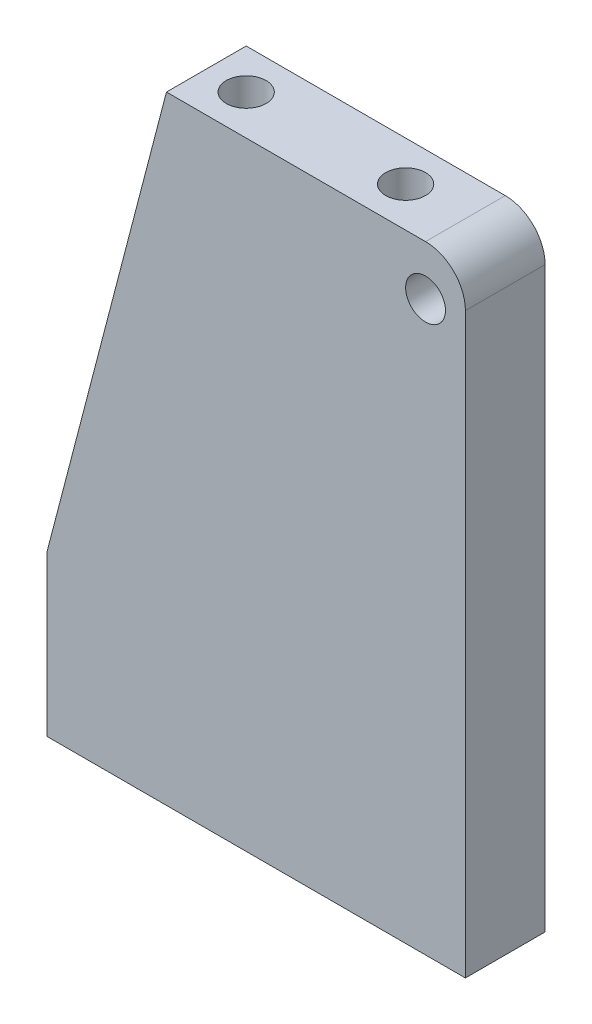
from build123d import *

# Parameters (mm, degrees)
SKETCH2_R                          = 3.175
BOSS_EXTRUDE1_DEPTH                = 6.35
F_5_16_0_3125_DIAMETER_HOLE1_D     = 7.9375
F_5_16_0_3125_DIAMETER_HOLE1_DEPTH = 19.05
F_5_16_0_3125_DIAMETER_HOLE1_TIP   = 2.384665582
F_1_4_0_25_DIAMETER_HOLE1_D        = 6.35
F_1_4_0_25_DIAMETER_HOLE1_DEPTH    = 19.05
F_1_4_0_25_DIAMETER_HOLE1_TIP      = 1.907732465
FILLET1_R                          = 6.35


with BuildPart() as part:
    # Sketch2 → Boss-Extrude1 (new, symmetric)
    with BuildSketch(Plane.XY):
        Polygon((0, 0), (33.3375, 0), (33.3375, 98.425), (-14.2875, 98.425), (-33.3375, 25.4), (-33.3375, 0), align=None)
        with Locations((26.9875, 90.5002)):
            Circle(SKETCH2_R, mode=Mode.SUBTRACT)
    extrude(amount=BOSS_EXTRUDE1_DEPTH, both=True)

    # 5_16 _0.3125_ Diameter Hole1
    with Locations(Plane(origin=(0, 0, 0), x_dir=(-1, 0, 0), z_dir=(0, -1, 0))):
        with Locations((25.4, 0), (-25.4, 0)):
            Hole(F_5_16_0_3125_DIAMETER_HOLE1_D / 2, depth=F_5_16_0_3125_DIAMETER_HOLE1_DEPTH)
            with Locations((0, 0, -(F_5_16_0_3125_DIAMETER_HOLE1_DEPTH + F_5_16_0_3125_DIAMETER_HOLE1_TIP / 2))):  # 118° drill point
                Cone(0, F_5_16_0_3125_DIAMETER_HOLE1_D / 2, F_5_16_0_3125_DIAMETER_HOLE1_TIP, mode=Mode.SUBTRACT)

    # 1_4 _0.25_ Diameter Hole1
    with Locations(Plane(origin=(0, 98.425, 0), x_dir=(1, 0, 0), z_dir=(0, 1, 0))):
        with Locations((-7.9375, 0), (17.4625, 0)):
            Hole(F_1_4_0_25_DIAMETER_HOLE1_D / 2, depth=F_1_4_0_25_DIAMETER_HOLE1_DEPTH)
            with Locations((0, 0, -(F_1_4_0_25_DIAMETER_HOLE1_DEPTH + F_1_4_0_25_DIAMETER_HOLE1_TIP / 2))):  # 118° drill point
                Cone(0, F_1_4_0_25_DIAMETER_HOLE1_D / 2, F_1_4_0_25_DIAMETER_HOLE1_TIP, mode=Mode.SUBTRACT)

    # Fillet1
    fillet1_edges = [part.edges().sort_by_distance(p)[0] for p in [
        (33.3375, 98.425, 0),
    ]]
    fillet(fillet1_edges, radius=FILLET1_R)


solid = part.part
